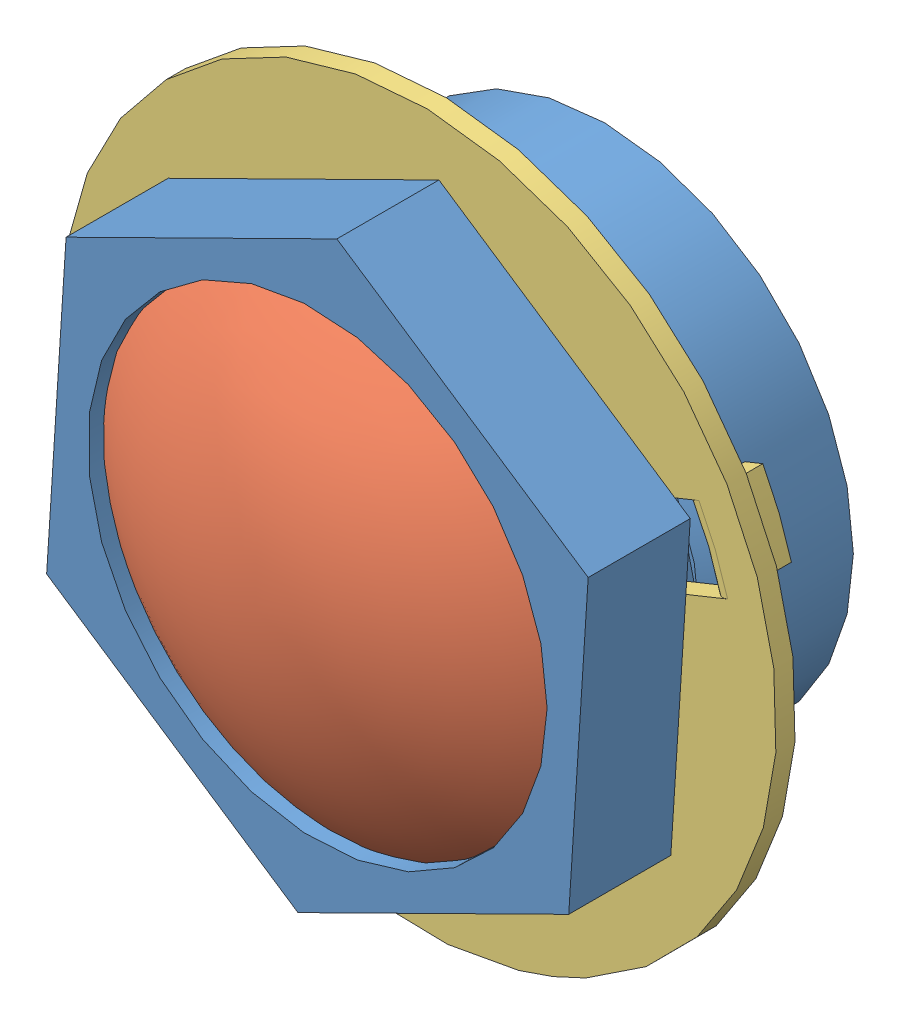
SolidWorks assembly SE Douille.SLDASM, configuration Défaut (file format 3800). Lengths in mm.
Overall size (72.87 72.87 27.3).
3 component instances, 3 part files, 4 mates.
Components (placement in the parent):
- Douille-1: Douille.SLDPRT [Défaut] at (-27.1154 12.2787 3.25) size (42.44 47.24 22.5)
- Bouchon expansible de 36 pour douille-1: Bouchon expansible de 36 pour douille.SLDPRT [Défaut] at (-16.375 17.6307 8.05) x (0.89503 0.446005 0) z (0.446005 -0.89503 0) size (36 7.8 36)
- Rondelle-frein-1: Rondelle-frein.SLDPRT [Défaut] at (-27.1154 12.2787 3.25) x (0.373658 -0.927566 0) z (0 0 -1) size (56 56 5.09)
Mates (geometry in assembly coordinates):
- Coaxial2: concentric aligned: cylinder of Douille-1; cylinder of Bouchon expansible de 36 pour douille-1
- Coïncidente1: coincident anti-aligned: plane of Douille-1 through (-27.1154 12.2787 8.25) normal (0 0 1); plane of Bouchon expansible de 36 pour douille-1 through (-43.2259 4.2506 8.25) normal (0 0 -1)
- Coïncidente2: coincident anti-aligned: axis of Douille-1; axis of Rondelle-frein-1
- Coïncidente3: coincident anti-aligned: plane of Douille-1 through (13.7996 9.6399 3.25) normal (0 0 -1); plane of Rondelle-frein-1 through (-27.1154 12.2787 3.25) normal (0 0 1)
